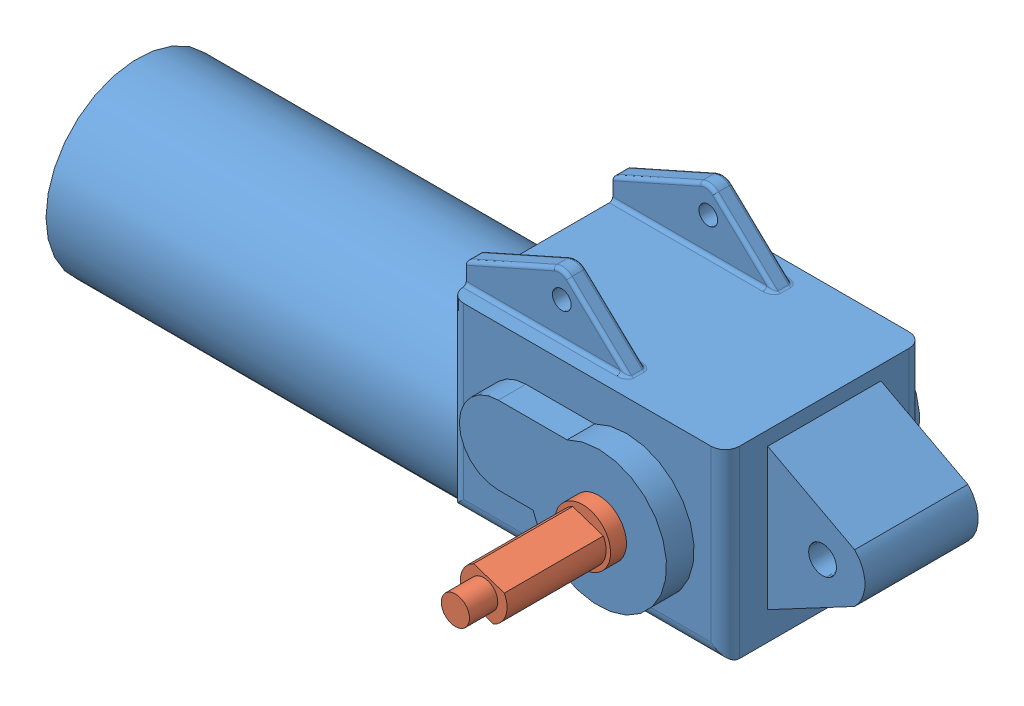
SolidWorks assembly Assem2.sldasm, configuration Default (file format 3400). Lengths in mm.
Overall size (351.63 132.18 177.93).
2 component instances, 2 part files, 1 mates.
Components (placement in the parent):
- wheelchairmotorR-1: wheelchairmotorR.SLDPRT [Default] at (-197.2415 -21.2304 8.8719) size (351.63 132.18 113.64)
- driveshaft-1: driveshaft.SLDPRT [Default] at (66.2835 -2.1804 59.3417) x (-0.949529 0.313678 0) z (0 0 1) size (25 25 70.64)
Mates (geometry in assembly coordinates):
- Coincident1: coincident aligned: circle of wheelchairmotorR-1; circle of driveshaft-1
